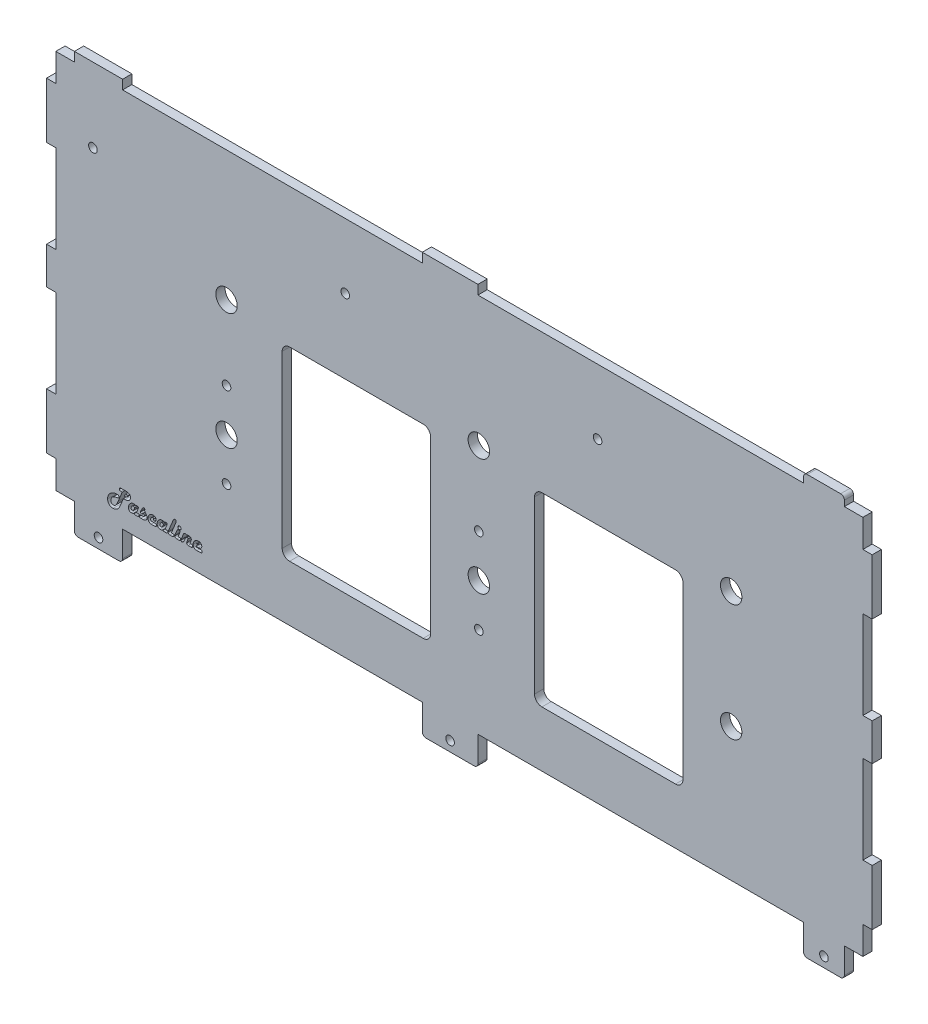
from build123d import *

# Parameters (mm, degrees)
SKETCH1_W             = 276.225
SKETCH1_H             = 130.175
SKETCH1_R             = 3.6703
SKETCH1_W_2           = 50.8
SKETCH1_H_2           = 63.5
BOSS_EXTRUDE1_DEPTH   = 3.175
FILLET1_R             = 2.54
SKETCH4_W             = 3.175
SKETCH4_H             = 19.05
SKETCH4_H_2           = 12.7
SKETCH4_W_2           = 16.51
SKETCH4_H_3           = 10.033
SKETCH4_W_3           = 19.05
SKETCH4_W_4           = 13.97
SKETCH4_H_4           = 3.175
BOSS_EXTRUDE2_DEPTH   = 3.175
F_4_CLEARANCE_HOLE1_D = 2.9464
FILLET2_R             = 1.27
CUT_EXTRUDE3_DEPTH    = 310.607272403


with BuildPart() as part:
    # Sketch1 → Boss-Extrude1 (new body)
    with BuildSketch(Plane.XY):
        with Locations((138.1125, 65.0875)):
            Rectangle(SKETCH1_W, SKETCH1_H)
        with Locations((58.42, 85.725)):
            Circle(SKETCH1_R, mode=Mode.SUBTRACT)
        with Locations((58.42, 45.72)):
            Circle(SKETCH1_R, mode=Mode.SUBTRACT)
        with Locations(Location((144.78, 45.72, 0), (0, 0, 180))):
            Circle(SKETCH1_R, mode=Mode.SUBTRACT)
        with Locations(Location((144.78, 85.725, 0), (0, 0, 180))):
            Circle(SKETCH1_R, mode=Mode.SUBTRACT)
        with Locations((231.14, 85.725)):
            Circle(SKETCH1_R, mode=Mode.SUBTRACT)
        with Locations((231.14, 45.72)):
            Circle(SKETCH1_R, mode=Mode.SUBTRACT)
        with Locations((102.87, 50.8)):
            Rectangle(SKETCH1_W_2, SKETCH1_H_2, mode=Mode.SUBTRACT)
        with Locations((189.23, 50.8)):
            Rectangle(SKETCH1_W_2, SKETCH1_H_2, mode=Mode.SUBTRACT)
    extrude(amount=BOSS_EXTRUDE1_DEPTH)

    # Fillet1
    fillet1_edges = [part.edges().sort_by_distance(p)[0] for p in [
        (128.27, 19.05, 1.5875),
        (128.27, 82.55, 1.5875),
        (77.47, 82.55, 1.5875),
        (77.47, 19.05, 1.5875),
        (214.63, 19.05, 1.5875),
        (214.63, 82.55, 1.5875),
        (163.83, 82.55, 1.5875),
        (163.83, 19.05, 1.5875),
    ]]
    fillet(fillet1_edges, radius=FILLET1_R)

    # Sketch4 → Boss-Extrude2 (add)
    with BuildSketch(Plane.XY):
        with Locations((277.8125, 19.05)):
            Rectangle(SKETCH4_W, SKETCH4_H)
        with Locations((277.8125, 111.125)):
            Rectangle(SKETCH4_W, SKETCH4_H)
        with Locations((-1.5875, 65.0875)):
            Rectangle(SKETCH4_W, SKETCH4_H_2)
        with Locations((277.8125, 65.0875)):
            Rectangle(SKETCH4_W, SKETCH4_H_2)
        with Locations((-1.5875, 19.05)):
            Rectangle(SKETCH4_W, SKETCH4_H)
        with Locations((-1.5875, 111.125)):
            Rectangle(SKETCH4_W, SKETCH4_H)
        with Locations((14.605, -5.0165)):
            Rectangle(SKETCH4_W_2, SKETCH4_H_3)
        with Locations((134.9375, -5.0165)):
            Rectangle(SKETCH4_W_3, SKETCH4_H_3)
        with Locations((262.89, -5.0165)):
            Rectangle(SKETCH4_W_4, SKETCH4_H_3)
        with Locations((14.605, 131.7625)):
            Rectangle(SKETCH4_W_2, SKETCH4_H_4)
        with Locations((134.9375, 131.7625)):
            Rectangle(SKETCH4_W_3, SKETCH4_H_4)
        with Locations((262.89, 131.7625)):
            Rectangle(SKETCH4_W_4, SKETCH4_H_4)
    extrude(amount=BOSS_EXTRUDE2_DEPTH)

    # 4 Clearance Hole1 (through all)
    with Locations(Plane.XY.offset(3.175)):
        with Locations((99.06, 107.95), (12.7, 107.95), (185.42, 107.95), (134.9375, -6.604), (14.605, -6.604), (262.89, -6.604), (58.42, 60.325), (58.42, 31.115), (144.78, 60.325), (144.78, 31.115)):
            Hole(F_4_CLEARANCE_HOLE1_D / 2)

    # Fillet2
    fillet2_edges = [part.edges().sort_by_distance(p)[0] for p in [
        (255.905, 133.35, 1.5875),
        (269.875, 133.35, 1.5875),
        (269.875, -10.033, 1.5875),
        (255.905, -10.033, 1.5875),
        (144.4625, -10.033, 1.5875),
        (125.4125, -10.033, 1.5875),
        (22.86, -10.033, 1.5875),
        (6.35, -10.033, 1.5875),
    ]]
    fillet(fillet2_edges, radius=FILLET2_R)

    # Sketch5 → Cut-Extrude3 (cut, through all)
    # profile 1 of 10: a face of its own
    with BuildSketch(Plane.XY.offset(3.175)):
        with BuildLine():
            Line((23.119201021, 9.164609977), (22.451206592, 7.500566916))
            add(Edge.make_bspline(
                [(22.451206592, 7.500566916), (22.411003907, 7.401430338), (22.333829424, 7.211124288), (22.219435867, 6.938643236), (22.112680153, 6.690113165), (22.012786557, 6.465475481), (21.920717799, 6.264069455), (21.833533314, 6.087517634), (21.755963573, 5.933870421), (21.661354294, 5.762755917), (21.539114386, 5.572432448), (21.375027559, 5.364837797), (21.194459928, 5.172753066), (21.060129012, 5.059889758), (20.992791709, 5.003313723)],
                knots=[0, 0, 0, 0, 1.315970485, 2.526183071, 3.635244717, 4.643279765, 5.550454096, 6.359128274, 7.065363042, 7.667512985, 8.763908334, 9.843272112, 10.918877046, 12, 12, 12, 12], degree=3))
            add(Edge.make_bspline(
                [(20.992791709, 5.003313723), (20.941866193, 4.965231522), (20.841070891, 4.889856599), (20.680401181, 4.792052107), (20.514563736, 4.708473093), (20.341573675, 4.641675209), (20.163005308, 4.589417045), (19.978244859, 4.551262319), (19.787353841, 4.528037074), (19.658056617, 4.52556047), (19.592618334, 4.524307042)],
                knots=[0, 0, 0, 0, 1.011044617, 2.001129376, 2.987597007, 3.961339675, 4.946518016, 5.943976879, 6.959431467, 8, 8, 8, 8], degree=3))
            add(Edge.make_bspline(
                [(19.592618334, 4.524307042), (19.523985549, 4.52577862), (19.389812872, 4.52865546), (19.193870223, 4.554855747), (19.007122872, 4.594062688), (18.83078106, 4.653339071), (18.663334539, 4.726507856), (18.506601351, 4.817898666), (18.35966799, 4.925082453), (18.22480845, 5.048815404), (18.102569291, 5.184697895), (17.996369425, 5.332046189), (17.904994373, 5.488467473), (17.831448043, 5.655681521), (17.774055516, 5.832504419), (17.734367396, 6.018966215), (17.708307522, 6.214954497), (17.70541107, 6.3491208), (17.70392946, 6.417750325)],
                knots=[0, 0, 0, 0, 1.095039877, 2.140732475, 3.150521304, 4.13652018, 5.104897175, 6.062745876, 7.026672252, 8.00261995, 8.979018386, 9.939223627, 10.897072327, 11.865449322, 12.849478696, 13.859267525, 14.904960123, 16, 16, 16, 16], degree=3))
            add(Edge.make_bspline(
                [(17.70392946, 6.417750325), (17.706469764, 6.510196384), (17.711485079, 6.692712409), (17.750571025, 6.961954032), (17.814671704, 7.222484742), (17.905671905, 7.473969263), (18.021297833, 7.716830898), (18.16431112, 7.949570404), (18.332042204, 8.17426002), (18.460931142, 8.313119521), (18.526442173, 8.383698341)],
                knots=[0, 0, 0, 0, 1.01377589, 2.001495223, 2.977585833, 3.952291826, 4.930103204, 5.92294397, 6.944284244, 8, 8, 8, 8], degree=3))
            add(Edge.make_bspline(
                [(18.526442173, 8.383698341), (18.564038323, 8.421013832), (18.639923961, 8.496332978), (18.762383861, 8.601213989), (18.891389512, 8.701406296), (19.026342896, 8.796968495), (19.169837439, 8.884085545), (19.318539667, 8.968473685), (19.475608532, 9.044630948), (19.690708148, 9.141268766), (19.965425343, 9.241006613), (20.2978387, 9.328678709), (20.629749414, 9.381793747), (20.850767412, 9.389158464), (20.96069945, 9.392821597)],
                knots=[0, 0, 0, 0, 0.706155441, 1.425333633, 2.148189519, 2.883981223, 3.628821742, 4.385725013, 5.163077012, 5.955384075, 7.529784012, 9.053423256, 10.534403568, 12, 12, 12, 12], degree=3))
            add(Edge.make_bspline(
                [(20.96069945, 9.392821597), (21.010777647, 9.391629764), (21.10661754, 9.389348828), (21.242284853, 9.36101028), (21.363435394, 9.317754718), (21.467338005, 9.255678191), (21.552788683, 9.180085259), (21.616087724, 9.091135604), (21.653226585, 8.989078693), (21.657440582, 8.917283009), (21.659597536, 8.880534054)],
                knots=[0, 0, 0, 0, 1.238826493, 2.370872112, 3.417595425, 4.41258701, 5.350953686, 6.225146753, 7.091533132, 8, 8, 8, 8], degree=3))
            add(Edge.make_bspline(
                [(21.659597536, 8.880534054), (21.657158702, 8.841764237), (21.65240403, 8.766179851), (21.612518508, 8.658791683), (21.545055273, 8.564566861), (21.48423124, 8.515858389), (21.452780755, 8.490672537)],
                knots=[0, 0, 0, 0, 1.010937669, 1.970891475, 2.950802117, 4, 4, 4, 4], degree=3))
            add(Edge.make_bspline(
                [(21.452780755, 8.490672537), (21.428650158, 8.476261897), (21.374303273, 8.443806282), (21.271172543, 8.413087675), (21.142728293, 8.387298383), (21.04721528, 8.377274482), (20.995168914, 8.371812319)],
                knots=[0, 0, 0, 0, 0.704559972, 1.586808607, 2.68501851, 4, 4, 4, 4], degree=3))
            add(Edge.make_bspline(
                [(20.995168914, 8.371812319), (20.930899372, 8.36533971), (20.80556437, 8.352717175), (20.622961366, 8.323144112), (20.44919412, 8.289935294), (20.285218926, 8.246571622), (20.130183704, 8.19766871), (19.983692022, 8.144126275), (19.847574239, 8.080489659), (19.761927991, 8.032764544), (19.719798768, 8.009288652)],
                knots=[0, 0, 0, 0, 1.159710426, 2.261604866, 3.320677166, 4.335395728, 5.305245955, 6.239579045, 7.134052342, 8, 8, 8, 8], degree=3))
            add(Edge.make_bspline(
                [(19.719798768, 8.009288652), (19.654419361, 7.967339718), (19.52562533, 7.884702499), (19.354426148, 7.733222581), (19.203332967, 7.564964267), (19.075629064, 7.379109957), (18.973627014, 7.181271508), (18.89879096, 6.976254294), (18.852926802, 6.765270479), (18.847636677, 6.622412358), (18.844987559, 6.550873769)],
                knots=[0, 0, 0, 0, 1.047576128, 2.063670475, 3.075290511, 4.094745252, 5.099666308, 6.072755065, 7.034899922, 8, 8, 8, 8], degree=3))
            add(Edge.make_bspline(
                [(18.844987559, 6.550873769), (18.845636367, 6.515185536), (18.846908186, 6.445228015), (18.857899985, 6.343133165), (18.875018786, 6.246246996), (18.901788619, 6.15588907), (18.933862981, 6.070634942), (18.972695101, 5.990387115), (19.020918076, 5.917086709), (19.073977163, 5.848438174), (19.13513267, 5.788442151), (19.199905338, 5.73415304), (19.271326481, 5.690354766), (19.346543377, 5.652700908), (19.427352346, 5.624580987), (19.513023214, 5.604540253), (19.603256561, 5.590584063), (19.665464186, 5.589730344), (19.697215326, 5.589294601)],
                knots=[0, 0, 0, 0, 1.180906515, 2.314860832, 3.395146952, 4.432720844, 5.428859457, 6.408284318, 7.375873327, 8.328235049, 9.274073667, 10.205991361, 11.119268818, 12.040047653, 12.985704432, 13.943108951, 14.9501506, 16, 16, 16, 16], degree=3))
            add(Edge.make_bspline(
                [(19.697215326, 5.589294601), (19.73772721, 5.590178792), (19.817696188, 5.591924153), (19.934736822, 5.613557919), (20.047745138, 5.64535598), (20.156538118, 5.691126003), (20.261491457, 5.749525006), (20.361851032, 5.821430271), (20.457232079, 5.906838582), (20.550130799, 6.005691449), (20.640514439, 6.122252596), (20.735291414, 6.255321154), (20.829339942, 6.410668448), (20.926497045, 6.585296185), (21.026287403, 6.779583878), (21.128874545, 6.99369617), (21.231187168, 7.22917089), (21.299659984, 7.393110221), (21.335109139, 7.477983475)],
                knots=[0, 0, 0, 0, 0.731682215, 1.444313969, 2.14503258, 2.851587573, 3.573238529, 4.31284086, 5.079201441, 5.885132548, 6.76239785, 7.744387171, 8.838039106, 10.04403949, 11.357848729, 12.787140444, 14.336666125, 16, 16, 16, 16], degree=3))
            Line((21.335109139, 7.477983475), (22.730528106, 10.914232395))
            Line((22.730528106, 10.914232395), (22.293122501, 10.914232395))
            add(Edge.make_bspline(
                [(22.293122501, 10.914232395), (22.249482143, 10.915318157), (22.167784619, 10.917350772), (22.053469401, 10.933486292), (21.955911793, 10.96103767), (21.875553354, 11.001448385), (21.812083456, 11.0538411), (21.766552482, 11.118910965), (21.739607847, 11.196317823), (21.737016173, 11.251577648), (21.735668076, 11.280321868)],
                knots=[0, 0, 0, 0, 1.386647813, 2.595892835, 3.659749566, 4.594681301, 5.434731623, 6.248703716, 7.089037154, 8, 8, 8, 8], degree=3))
            add(Edge.make_bspline(
                [(21.735668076, 11.280321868), (21.737604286, 11.321461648), (21.741339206, 11.400819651), (21.780099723, 11.512122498), (21.841922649, 11.609323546), (21.930694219, 11.688476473), (22.040352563, 11.751577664), (22.17060237, 11.796320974), (22.320267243, 11.821779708), (22.426142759, 11.825246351), (22.482110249, 11.827078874)],
                knots=[0, 0, 0, 0, 0.942601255, 1.818263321, 2.674766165, 3.564433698, 4.523656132, 5.566505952, 6.713616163, 8, 8, 8, 8], degree=3))
            Line((22.482110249, 11.827078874), (24.009464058, 11.827078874))
            add(Edge.make_bspline(
                [(24.009464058, 11.827078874), (24.07248493, 11.826141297), (24.194705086, 11.824322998), (24.371659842, 11.811086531), (24.536158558, 11.790426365), (24.687661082, 11.7598162), (24.826003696, 11.719494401), (24.951704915, 11.670604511), (25.065549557, 11.614116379), (25.166457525, 11.546868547), (25.254881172, 11.47075861), (25.331318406, 11.384834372), (25.394973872, 11.289168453), (25.449869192, 11.185035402), (25.489653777, 11.069843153), (25.51766631, 10.945418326), (25.536143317, 10.81176616), (25.53815736, 10.719365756), (25.539195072, 10.671757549)],
                knots=[0, 0, 0, 0, 1.377685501, 2.671828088, 3.877302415, 5.000186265, 6.047243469, 7.023626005, 7.94558449, 8.820055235, 9.667510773, 10.489711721, 11.325757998, 12.174186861, 13.056345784, 13.980864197, 14.959664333, 16, 16, 16, 16], degree=3))
            add(Edge.make_bspline(
                [(25.539195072, 10.671757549), (25.537217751, 10.613032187), (25.533336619, 10.497764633), (25.507219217, 10.328808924), (25.461558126, 10.168586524), (25.398541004, 10.016101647), (25.315426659, 9.873155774), (25.215734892, 9.73744145), (25.098243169, 9.609536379), (25.007634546, 9.534438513), (24.961534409, 9.496229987)],
                knots=[0, 0, 0, 0, 1.037190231, 2.03582197, 3.010506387, 3.973515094, 4.942177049, 5.923321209, 6.943420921, 8, 8, 8, 8], degree=3))
            add(Edge.make_bspline(
                [(24.961534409, 9.496229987), (24.924861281, 9.469591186), (24.849567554, 9.414898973), (24.722279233, 9.347795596), (24.581294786, 9.290628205), (24.42582274, 9.24494617), (24.257052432, 9.208122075), (24.073914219, 9.182358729), (23.876613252, 9.166850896), (23.740077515, 9.16537344), (23.669523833, 9.164609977)],
                knots=[0, 0, 0, 0, 0.800437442, 1.643380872, 2.535600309, 3.486195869, 4.50417187, 5.586788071, 6.752993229, 8, 8, 8, 8], degree=3))
            Line((23.669523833, 9.164609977), (23.119201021, 9.164609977))
        make_face()
        with BuildLine():
            Line((23.509062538, 10.077456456), (23.833550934, 10.077456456))
            add(Edge.make_bspline(
                [(23.833550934, 10.077456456), (23.883581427, 10.078871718), (23.978009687, 10.081542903), (24.109812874, 10.105830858), (24.222265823, 10.147368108), (24.315221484, 10.206091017), (24.38842248, 10.283422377), (24.437974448, 10.379084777), (24.470358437, 10.489814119), (24.47287967, 10.569284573), (24.474207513, 10.611138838)],
                knots=[0, 0, 0, 0, 1.258971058, 2.376199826, 3.358208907, 4.260347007, 5.121448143, 6.005251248, 6.949436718, 8, 8, 8, 8], degree=3))
            add(Edge.make_bspline(
                [(24.474207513, 10.611138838), (24.473067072, 10.634992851), (24.470906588, 10.680182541), (24.45485612, 10.743618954), (24.424912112, 10.796445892), (24.384765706, 10.841296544), (24.331090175, 10.873849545), (24.267531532, 10.898068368), (24.192697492, 10.911946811), (24.139079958, 10.913437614), (24.110495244, 10.914232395)],
                knots=[0, 0, 0, 0, 1.057975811, 2.004258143, 2.869579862, 3.727735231, 4.644179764, 5.623179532, 6.73286349, 8, 8, 8, 8], degree=3))
            Line((24.110495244, 10.914232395), (23.84187115, 10.914232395))
            Line((23.84187115, 10.914232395), (23.509062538, 10.077456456))
        make_face(mode=Mode.SUBTRACT)
    # profile 2 of 10: a face of its own
    with BuildSketch(Plane.XY.offset(3.175)):
        with BuildLine():
            Line((27.590722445, 7.262846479), (28.032882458, 7.262846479))
            add(Edge.make_bspline(
                [(28.032882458, 7.262846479), (28.069771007, 7.26168404), (28.139217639, 7.259495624), (28.237100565, 7.244044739), (28.319497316, 7.213913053), (28.389453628, 7.175207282), (28.441730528, 7.120759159), (28.479643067, 7.055670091), (28.502815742, 6.978700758), (28.504866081, 6.923472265), (28.505946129, 6.894379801)],
                knots=[0, 0, 0, 0, 1.294214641, 2.436497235, 3.45633191, 4.35958604, 5.214514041, 6.067746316, 6.982155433, 8, 8, 8, 8], degree=3))
            add(Edge.make_bspline(
                [(28.505946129, 6.894379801), (28.504075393, 6.853751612), (28.500488, 6.775841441), (28.467922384, 6.66547908), (28.411237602, 6.570686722), (28.335484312, 6.489620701), (28.239850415, 6.426705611), (28.127852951, 6.380604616), (27.999107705, 6.355527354), (27.90818237, 6.351900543), (27.860535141, 6.35)],
                knots=[0, 0, 0, 0, 1.02006706, 1.956119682, 2.85821293, 3.77438774, 4.72208319, 5.713685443, 6.801912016, 8, 8, 8, 8], degree=3))
            Line((27.860535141, 6.35), (27.347058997, 6.35))
            add(Edge.make_bspline(
                [(27.347058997, 6.35), (27.319272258, 6.350924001), (27.266140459, 6.35269081), (27.189661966, 6.365809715), (27.119931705, 6.388489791), (27.056725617, 6.420297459), (27.001086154, 6.461923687), (26.951568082, 6.511009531), (26.909321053, 6.570088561), (26.888358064, 6.614676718), (26.877561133, 6.637641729)],
                knots=[0, 0, 0, 0, 1.135602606, 2.17141737, 3.159933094, 4.123316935, 5.049777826, 5.988893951, 6.964185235, 8, 8, 8, 8], degree=3))
            add(Edge.make_bspline(
                [(26.877561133, 6.637641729), (26.829418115, 6.593791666), (26.738706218, 6.511168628), (26.589078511, 6.421916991), (26.442765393, 6.360717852), (26.343224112, 6.353490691), (26.295146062, 6.35)],
                knots=[0, 0, 0, 0, 1.172355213, 2.208971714, 3.134940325, 4, 4, 4, 4], degree=3))
            Line((26.295146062, 6.35), (25.838722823, 6.35))
            add(Edge.make_bspline(
                [(25.838722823, 6.35), (25.802613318, 6.350846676), (25.732080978, 6.352500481), (25.629021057, 6.36739538), (25.530996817, 6.390336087), (25.439134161, 6.425910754), (25.351766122, 6.468220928), (25.269891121, 6.521254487), (25.194345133, 6.584489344), (25.123714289, 6.655720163), (25.061392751, 6.735720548), (25.004824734, 6.82093039), (24.958631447, 6.913392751), (24.9203783, 7.011259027), (24.891018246, 7.114802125), (24.869013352, 7.224008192), (24.857836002, 7.339477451), (24.855668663, 7.418533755), (24.854560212, 7.45896584)],
                knots=[0, 0, 0, 0, 1.038881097, 2.029236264, 2.991883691, 3.930308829, 4.858629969, 5.782385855, 6.730121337, 7.689859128, 8.664191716, 9.644845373, 10.629272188, 11.633194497, 12.665607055, 13.723595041, 14.835769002, 16, 16, 16, 16], degree=3))
            add(Edge.make_bspline(
                [(24.854560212, 7.45896584), (24.85610135, 7.520862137), (24.859147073, 7.643186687), (24.885247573, 7.824235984), (24.926425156, 8.000246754), (24.985151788, 8.171403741), (25.060821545, 8.33685869), (25.150817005, 8.498507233), (25.260719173, 8.653277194), (25.383466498, 8.802278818), (25.517065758, 8.939411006), (25.65634466, 9.060947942), (25.801550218, 9.162226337), (25.949498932, 9.247803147), (26.103529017, 9.312208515), (26.26118757, 9.359174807), (26.423717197, 9.387067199), (26.533554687, 9.390897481), (26.588730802, 9.392821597)],
                knots=[0, 0, 0, 0, 1.038393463, 2.052158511, 3.063456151, 4.068635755, 5.08344709, 6.113632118, 7.168837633, 8.264602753, 9.350863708, 10.378663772, 11.361961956, 12.31789787, 13.241700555, 14.156967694, 15.07416527, 16, 16, 16, 16], degree=3))
            add(Edge.make_bspline(
                [(26.588730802, 9.392821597), (26.629955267, 9.391802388), (26.709847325, 9.389827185), (26.825936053, 9.377663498), (26.93284671, 9.352720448), (27.032648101, 9.323430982), (27.12225627, 9.280706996), (27.204008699, 9.230733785), (27.277694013, 9.171469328), (27.318416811, 9.124076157), (27.338738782, 9.100425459)],
                knots=[0, 0, 0, 0, 1.187749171, 2.30183041, 3.353985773, 4.346587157, 5.291117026, 6.203238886, 7.103359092, 8, 8, 8, 8], degree=3))
            add(Edge.make_bspline(
                [(27.338738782, 9.100425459), (27.355674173, 9.123800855), (27.388572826, 9.169209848), (27.444893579, 9.229036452), (27.505129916, 9.279630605), (27.568893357, 9.321936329), (27.638154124, 9.352158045), (27.709275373, 9.377183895), (27.78560771, 9.389834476), (27.837518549, 9.391809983), (27.864100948, 9.392821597)],
                knots=[0, 0, 0, 0, 1.102961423, 2.142610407, 3.131917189, 4.106850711, 5.056016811, 6.014208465, 6.983119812, 8, 8, 8, 8], degree=3))
            add(Edge.make_bspline(
                [(27.864100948, 9.392821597), (27.892332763, 9.391374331), (27.947568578, 9.388542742), (28.026788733, 9.368747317), (28.097661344, 9.332619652), (28.159912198, 9.285477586), (28.212990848, 9.22913499), (28.25007614, 9.163329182), (28.274365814, 9.091402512), (28.276592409, 9.040801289), (28.277734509, 9.014846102)],
                knots=[0, 0, 0, 0, 1.085152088, 2.123110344, 3.11068521, 4.121931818, 5.11360817, 6.061884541, 7.005870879, 8, 8, 8, 8], degree=3))
            add(Edge.make_bspline(
                [(28.277734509, 9.014846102), (28.277038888, 8.995776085), (28.275563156, 8.955319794), (28.262690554, 8.892397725), (28.242496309, 8.824341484), (28.223506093, 8.778549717), (28.213549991, 8.754542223)],
                knots=[0, 0, 0, 0, 0.847236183, 1.797378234, 2.845219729, 4, 4, 4, 4], degree=3))
            Line((28.213549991, 8.754542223), (28.16957171, 8.648756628))
            Line((28.16957171, 8.648756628), (27.590722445, 7.262846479))
        make_face()
        with BuildLine():
            Line((26.134684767, 7.262846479), (26.235715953, 7.262846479))
            add(Edge.make_bspline(
                [(26.235715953, 7.262846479), (26.261118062, 7.263403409), (26.310245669, 7.264480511), (26.380704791, 7.276313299), (26.444219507, 7.296625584), (26.501442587, 7.324150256), (26.551533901, 7.360081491), (26.595304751, 7.403527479), (26.631459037, 7.455722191), (26.649532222, 7.494711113), (26.658858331, 7.514830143)],
                knots=[0, 0, 0, 0, 1.157664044, 2.238919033, 3.244614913, 4.190073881, 5.122668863, 6.042574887, 6.989931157, 8, 8, 8, 8], degree=3))
            Line((26.658858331, 7.514830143), (26.92985963, 8.166184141))
            add(Edge.make_bspline(
                [(26.92985963, 8.166184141), (26.946051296, 8.204845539), (26.974847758, 8.27360384), (26.981585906, 8.347699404), (26.98453533, 8.380132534)],
                knots=[0, 0, 0, 0, 1.124559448, 2, 2, 2, 2], degree=3))
            add(Edge.make_bspline(
                [(26.98453533, 8.380132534), (26.982919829, 8.396510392), (26.979660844, 8.429549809), (26.960273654, 8.478036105), (26.923140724, 8.519372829), (26.877468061, 8.558290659), (26.822149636, 8.591249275), (26.759781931, 8.614843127), (26.692035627, 8.629673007), (26.645070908, 8.631284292), (26.620823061, 8.632116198)],
                knots=[0, 0, 0, 0, 0.81058345, 1.635208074, 2.524363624, 3.523748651, 4.593951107, 5.683817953, 6.804157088, 8, 8, 8, 8], degree=3))
            add(Edge.make_bspline(
                [(26.620823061, 8.632116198), (26.596174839, 8.63128371), (26.546394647, 8.629602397), (26.472572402, 8.613117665), (26.399545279, 8.588130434), (26.327079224, 8.552743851), (26.255132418, 8.507577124), (26.183183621, 8.452598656), (26.113420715, 8.386315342), (26.021876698, 8.289084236), (25.923002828, 8.158030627), (25.834330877, 7.992365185), (25.778103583, 7.822683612), (25.770947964, 7.707389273), (25.767406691, 7.650330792)],
                knots=[0, 0, 0, 0, 0.627706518, 1.267732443, 1.919531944, 2.592823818, 3.31892668, 4.082778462, 4.897707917, 5.769757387, 7.487317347, 9.064628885, 10.547302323, 12, 12, 12, 12], degree=3))
            add(Edge.make_bspline(
                [(25.767406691, 7.650330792), (25.768547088, 7.620143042), (25.770712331, 7.562826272), (25.786711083, 7.482537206), (25.814989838, 7.413874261), (25.857126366, 7.358291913), (25.910530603, 7.314821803), (25.97542406, 7.283164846), (26.051786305, 7.265877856), (26.106072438, 7.263892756), (26.134684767, 7.262846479)],
                knots=[0, 0, 0, 0, 1.183693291, 2.247450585, 3.194323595, 4.070859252, 4.954393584, 5.871857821, 6.878330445, 8, 8, 8, 8], degree=3))
        make_face(mode=Mode.SUBTRACT)
    # profile 3 of 10: a face of its own
    with BuildSketch(Plane.XY.offset(3.175)):
        with BuildLine():
            Line((29.990510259, 8.330211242), (29.912062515, 8.16024113))
            add(Edge.make_bspline(
                [(29.912062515, 8.16024113), (29.896884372, 8.131312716), (29.86769618, 8.07568219), (29.814544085, 8.00141012), (29.757815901, 7.937540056), (29.695046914, 7.885850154), (29.628129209, 7.844607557), (29.555769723, 7.815808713), (29.478606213, 7.79887687), (29.425612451, 7.796534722), (29.39858637, 7.795340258)],
                knots=[0, 0, 0, 0, 1.174117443, 2.257875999, 3.277186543, 4.239058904, 5.172954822, 6.09414408, 7.028039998, 8, 8, 8, 8], degree=3))
            add(Edge.make_bspline(
                [(29.39858637, 7.795340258), (29.371134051, 7.796795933), (29.316667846, 7.799684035), (29.237096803, 7.82031378), (29.16263589, 7.855638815), (29.09462143, 7.902428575), (29.037107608, 7.958103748), (28.993789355, 8.019877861), (28.967174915, 8.086882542), (28.963967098, 8.133470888), (28.962369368, 8.156675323)],
                knots=[0, 0, 0, 0, 1.057292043, 2.097698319, 3.142574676, 4.21811325, 5.26521749, 6.20945791, 7.108177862, 8, 8, 8, 8], degree=3))
            add(Edge.make_bspline(
                [(28.962369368, 8.156675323), (28.963902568, 8.18098518), (28.967274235, 8.234445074), (28.992789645, 8.318434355), (29.027799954, 8.414397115), (29.061029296, 8.47951667), (29.078852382, 8.514444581)],
                knots=[0, 0, 0, 0, 0.768398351, 1.68978755, 2.760880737, 4, 4, 4, 4], degree=3))
            Line((29.078852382, 8.514444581), (29.612534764, 9.55209429))
            add(Edge.make_bspline(
                [(29.612534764, 9.55209429), (29.628998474, 9.581760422), (29.660355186, 9.638262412), (29.714608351, 9.714353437), (29.771846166, 9.778597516), (29.830813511, 9.833390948), (29.894697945, 9.874194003), (29.961322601, 9.90314064), (30.030689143, 9.921974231), (30.078349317, 9.92419981), (30.102238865, 9.925315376)],
                knots=[0, 0, 0, 0, 1.254889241, 2.390056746, 3.44940031, 4.435704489, 5.358962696, 6.23882182, 7.117213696, 8, 8, 8, 8], degree=3))
            add(Edge.make_bspline(
                [(30.102238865, 9.925315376), (30.127723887, 9.924333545), (30.177477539, 9.922416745), (30.249027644, 9.902648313), (30.314253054, 9.870016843), (30.371649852, 9.82561983), (30.422350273, 9.775108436), (30.456581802, 9.715249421), (30.480139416, 9.651678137), (30.482550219, 9.606987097), (30.483780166, 9.584186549)],
                knots=[0, 0, 0, 0, 1.076175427, 2.100985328, 3.113101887, 4.142426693, 5.162150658, 6.116677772, 7.039163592, 8, 8, 8, 8], degree=3))
            add(Edge.make_bspline(
                [(30.483780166, 9.584186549), (30.483189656, 9.576625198), (30.481707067, 9.55764097), (30.472108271, 9.524410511), (30.457923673, 9.48041725), (30.445526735, 9.447837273), (30.438613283, 9.429668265)],
                knots=[0, 0, 0, 0, 0.562304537, 1.411773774, 2.556613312, 4, 4, 4, 4], degree=3))
            add(Edge.make_bspline(
                [(30.438613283, 9.429668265), (30.429934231, 9.4021552), (30.4139082, 9.351351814), (30.409658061, 9.29828798), (30.407709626, 9.273961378)],
                knots=[0, 0, 0, 0, 1.083119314, 2, 2, 2, 2], degree=3))
            add(Edge.make_bspline(
                [(30.407709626, 9.273961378), (30.410360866, 9.231672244), (30.41576673, 9.145444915), (30.457407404, 9.016624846), (30.521341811, 8.886134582), (30.581783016, 8.805145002), (30.613337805, 8.762862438)],
                knots=[0, 0, 0, 0, 0.903479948, 1.84219102, 2.873463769, 4, 4, 4, 4], degree=3))
            Line((30.613337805, 8.762862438), (30.862944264, 8.449071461))
            add(Edge.make_bspline(
                [(30.862944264, 8.449071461), (30.89315876, 8.40941273), (30.95181765, 8.332418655), (31.029517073, 8.213642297), (31.096639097, 8.096689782), (31.150204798, 7.979553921), (31.192582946, 7.863611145), (31.222000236, 7.748525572), (31.241056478, 7.634323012), (31.243346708, 7.558484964), (31.244485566, 7.520773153)],
                knots=[0, 0, 0, 0, 1.169686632, 2.270847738, 3.328397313, 4.331060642, 5.289870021, 6.221237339, 7.115478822, 8, 8, 8, 8], degree=3))
            add(Edge.make_bspline(
                [(31.244485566, 7.520773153), (31.243374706, 7.479898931), (31.241185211, 7.399336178), (31.222953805, 7.281348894), (31.193158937, 7.168541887), (31.151222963, 7.060930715), (31.097710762, 6.958280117), (31.031457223, 6.861340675), (30.953690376, 6.769443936), (30.865170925, 6.683679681), (30.768195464, 6.604874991), (30.663003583, 6.537900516), (30.55370701, 6.478341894), (30.437152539, 6.432662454), (30.315721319, 6.395108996), (30.188203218, 6.369932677), (30.055210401, 6.351843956), (29.964426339, 6.35062387), (29.918005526, 6.35)],
                knots=[0, 0, 0, 0, 0.993241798, 1.957671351, 2.894532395, 3.824635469, 4.759513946, 5.702543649, 6.673110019, 7.681185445, 8.695042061, 9.70491044, 10.708882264, 11.715852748, 12.742665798, 13.794825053, 14.872423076, 16, 16, 16, 16], degree=3))
            Line((29.918005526, 6.35), (29.080040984, 6.35))
            add(Edge.make_bspline(
                [(29.080040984, 6.35), (29.041166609, 6.351148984), (28.968164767, 6.353306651), (28.865667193, 6.368799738), (28.778850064, 6.39860707), (28.70672086, 6.439016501), (28.649687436, 6.491477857), (28.609138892, 6.556610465), (28.58673032, 6.634252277), (28.583643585, 6.689400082), (28.582016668, 6.718466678)],
                knots=[0, 0, 0, 0, 1.323532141, 2.485449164, 3.513452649, 4.431917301, 5.281225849, 6.123328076, 7.010867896, 8, 8, 8, 8], degree=3))
            add(Edge.make_bspline(
                [(28.582016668, 6.718466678), (28.583766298, 6.759131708), (28.587126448, 6.837228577), (28.621444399, 6.947402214), (28.678777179, 7.042559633), (28.758030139, 7.122462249), (28.857096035, 7.185049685), (28.972704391, 7.232327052), (29.105937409, 7.257322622), (29.199599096, 7.26094353), (29.248822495, 7.262846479)],
                knots=[0, 0, 0, 0, 1.001377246, 1.923137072, 2.813709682, 3.719614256, 4.674449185, 5.687788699, 6.784829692, 8, 8, 8, 8], degree=3))
            Line((29.248822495, 7.262846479), (29.71356595, 7.262846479))
            add(Edge.make_bspline(
                [(29.71356595, 7.262846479), (29.761976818, 7.263714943), (29.852890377, 7.265345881), (29.979460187, 7.28416678), (30.087169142, 7.314282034), (30.176102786, 7.356875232), (30.246912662, 7.412505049), (30.297305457, 7.482368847), (30.326991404, 7.565690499), (30.330040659, 7.625120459), (30.331639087, 7.656273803)],
                knots=[0, 0, 0, 0, 1.402558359, 2.633945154, 3.698995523, 4.63394819, 5.475307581, 6.281836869, 7.099334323, 8, 8, 8, 8], degree=3))
            add(Edge.make_bspline(
                [(30.331639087, 7.656273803), (30.329759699, 7.681390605), (30.325750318, 7.734973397), (30.29981842, 7.817251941), (30.260510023, 7.906123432), (30.223911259, 7.964172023), (30.204458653, 7.995025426)],
                knots=[0, 0, 0, 0, 0.822745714, 1.755200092, 2.806866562, 4, 4, 4, 4], degree=3))
            Line((30.204458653, 7.995025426), (29.990510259, 8.330211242))
        make_face()
    # profile 4 of 10: a face of its own
    with BuildSketch(Plane.XY.offset(3.175)):
        with BuildLine():
            Line((33.843958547, 6.35), (32.680317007, 6.35))
            add(Edge.make_bspline(
                [(32.680317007, 6.35), (32.639473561, 6.351331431), (32.559475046, 6.353939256), (32.442122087, 6.368805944), (32.331089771, 6.397249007), (32.224677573, 6.432858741), (32.125228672, 6.482977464), (32.031435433, 6.542005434), (31.943344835, 6.612135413), (31.862148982, 6.692296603), (31.788904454, 6.781373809), (31.723642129, 6.876673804), (31.67087138, 6.979950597), (31.624984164, 7.087986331), (31.590247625, 7.203147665), (31.567630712, 7.324780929), (31.550914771, 7.452170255), (31.549492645, 7.539336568), (31.548767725, 7.583769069)],
                knots=[0, 0, 0, 0, 1.04308008, 2.043041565, 3.012085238, 3.965374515, 4.901770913, 5.84746328, 6.790555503, 7.770466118, 8.754752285, 9.731054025, 10.712842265, 11.710345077, 12.724731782, 13.776116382, 14.86638876, 16, 16, 16, 16], degree=3))
            add(Edge.make_bspline(
                [(31.548767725, 7.583769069), (31.550434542, 7.643669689), (31.553726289, 7.761965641), (31.577855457, 7.936444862), (31.618616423, 8.105181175), (31.675046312, 8.268099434), (31.750410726, 8.42377383), (31.839361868, 8.574392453), (31.946140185, 8.718148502), (32.065971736, 8.855189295), (32.19833574, 8.979735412), (32.336825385, 9.090917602), (32.481896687, 9.184309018), (32.632077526, 9.261377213), (32.789231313, 9.319248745), (32.951349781, 9.362816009), (33.119703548, 9.388030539), (33.233728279, 9.391214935), (33.29125853, 9.392821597)],
                knots=[0, 0, 0, 0, 1.033018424, 2.040077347, 3.031267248, 4.023304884, 5.007568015, 6.009629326, 7.036117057, 8.091719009, 9.145549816, 10.16692925, 11.15074152, 12.116516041, 13.072326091, 14.033738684, 15.007938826, 16, 16, 16, 16], degree=3))
            add(Edge.make_bspline(
                [(33.29125853, 9.392821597), (33.330123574, 9.39229061), (33.406065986, 9.391253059), (33.516835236, 9.378681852), (33.62234278, 9.360223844), (33.721984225, 9.332564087), (33.816684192, 9.298575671), (33.904919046, 9.254933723), (33.988753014, 9.205465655), (34.065535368, 9.147041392), (34.135215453, 9.083436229), (34.197063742, 9.015218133), (34.248354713, 8.941154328), (34.289538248, 8.862143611), (34.324343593, 8.779529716), (34.345526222, 8.691155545), (34.361010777, 8.598583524), (34.362575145, 8.535117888), (34.363377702, 8.502558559)],
                knots=[0, 0, 0, 0, 1.192851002, 2.330834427, 3.419016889, 4.478598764, 5.502444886, 6.503631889, 7.49680333, 8.487139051, 9.460210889, 10.390750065, 11.308717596, 12.217610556, 13.123567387, 14.053072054, 15.001181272, 16, 16, 16, 16], degree=3))
            add(Edge.make_bspline(
                [(34.363377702, 8.502558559), (34.361783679, 8.458384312), (34.358716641, 8.37338923), (34.328641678, 8.252278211), (34.283123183, 8.141976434), (34.216010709, 8.047284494), (34.135293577, 7.969033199), (34.041830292, 7.91161127), (33.936681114, 7.87676091), (33.862847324, 7.873225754), (33.824940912, 7.871410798)],
                knots=[0, 0, 0, 0, 1.140049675, 2.193554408, 3.207776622, 4.208142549, 5.171800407, 6.095933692, 7.022448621, 8, 8, 8, 8], degree=3))
            add(Edge.make_bspline(
                [(33.824940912, 7.871410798), (33.795542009, 7.87215502), (33.740311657, 7.873553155), (33.663568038, 7.888085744), (33.597715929, 7.909794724), (33.543778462, 7.942790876), (33.500419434, 7.984790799), (33.471820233, 8.038507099), (33.453420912, 8.100004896), (33.451523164, 8.144247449), (33.450531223, 8.167372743)],
                knots=[0, 0, 0, 0, 1.293872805, 2.430738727, 3.43019671, 4.33150824, 5.195698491, 6.055468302, 6.983605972, 8, 8, 8, 8], degree=3))
            add(Edge.make_bspline(
                [(33.450531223, 8.167372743), (33.450531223, 8.181239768), (33.450531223, 8.206596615), (33.450531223, 8.231953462), (33.450531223, 8.243443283)],
                knots=[0, 0, 0, 0, 1.09375, 2, 2, 2, 2], degree=3))
            add(Edge.make_bspline(
                [(33.450531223, 8.243443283), (33.450531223, 8.255725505), (33.450531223, 8.279497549), (33.450531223, 8.303269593), (33.450531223, 8.314759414)],
                knots=[0, 0, 0, 0, 1.033333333, 2, 2, 2, 2], degree=3))
            add(Edge.make_bspline(
                [(33.450531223, 8.314759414), (33.44967953, 8.333876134), (33.448077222, 8.369840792), (33.434613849, 8.419916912), (33.413511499, 8.463087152), (33.380914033, 8.497551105), (33.339478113, 8.523737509), (33.289753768, 8.542520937), (33.231618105, 8.554749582), (33.189901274, 8.555594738), (33.167643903, 8.556045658)],
                knots=[0, 0, 0, 0, 1.076936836, 2.026062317, 2.906040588, 3.760364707, 4.665822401, 5.649858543, 6.746118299, 8, 8, 8, 8], degree=3))
            add(Edge.make_bspline(
                [(33.167643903, 8.556045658), (33.123621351, 8.553163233), (33.034942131, 8.547356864), (32.906677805, 8.495910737), (32.786484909, 8.413771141), (32.676556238, 8.304885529), (32.583034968, 8.177699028), (32.511892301, 8.039385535), (32.470278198, 7.891609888), (32.464516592, 7.790439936), (32.461614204, 7.739475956)],
                knots=[0, 0, 0, 0, 0.889989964, 1.79279967, 2.759962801, 3.828151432, 4.914528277, 5.949409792, 6.967022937, 8, 8, 8, 8], degree=3))
            add(Edge.make_bspline(
                [(32.461614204, 7.739475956), (32.463855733, 7.699247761), (32.468094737, 7.623171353), (32.500732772, 7.517048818), (32.560782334, 7.431656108), (32.643809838, 7.363978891), (32.755272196, 7.317078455), (32.894754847, 7.2858988), (33.064490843, 7.266324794), (33.187790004, 7.264066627), (33.254411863, 7.262846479)],
                knots=[0, 0, 0, 0, 0.913027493, 1.726645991, 2.482782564, 3.249916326, 4.127695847, 5.201188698, 6.487726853, 8, 8, 8, 8], degree=3))
            Line((33.254411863, 7.262846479), (34.012740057, 7.262846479))
            add(Edge.make_bspline(
                [(34.012740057, 7.262846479), (34.052054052, 7.261906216), (34.125991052, 7.260137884), (34.229054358, 7.242045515), (34.317391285, 7.214818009), (34.390470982, 7.173472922), (34.447565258, 7.119330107), (34.488145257, 7.052929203), (34.510965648, 6.974664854), (34.513940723, 6.919099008), (34.515518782, 6.889625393)],
                knots=[0, 0, 0, 0, 1.322009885, 2.486276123, 3.511116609, 4.419281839, 5.287086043, 6.131096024, 7.008683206, 8, 8, 8, 8], degree=3))
            add(Edge.make_bspline(
                [(34.515518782, 6.889625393), (34.513867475, 6.849711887), (34.510676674, 6.772587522), (34.474586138, 6.664416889), (34.416987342, 6.569236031), (34.336227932, 6.489587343), (34.236195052, 6.426608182), (34.119790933, 6.380845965), (33.986884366, 6.355420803), (33.893195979, 6.351867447), (33.843958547, 6.35)],
                knots=[0, 0, 0, 0, 0.982987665, 1.899414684, 2.782606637, 3.710260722, 4.674394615, 5.685217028, 6.783478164, 8, 8, 8, 8], degree=3))
        make_face()
    # profile 5 of 10: a face of its own
    with BuildSketch(Plane.XY.offset(3.175)):
        with BuildLine():
            Line((37.403822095, 7.262846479), (37.845982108, 7.262846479))
            add(Edge.make_bspline(
                [(37.845982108, 7.262846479), (37.882870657, 7.26168404), (37.952317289, 7.259495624), (38.050200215, 7.244044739), (38.132596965, 7.213913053), (38.202553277, 7.175207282), (38.254830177, 7.120759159), (38.292742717, 7.055670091), (38.315915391, 6.978700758), (38.31796573, 6.923472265), (38.319045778, 6.894379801)],
                knots=[0, 0, 0, 0, 1.294214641, 2.436497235, 3.45633191, 4.35958604, 5.214514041, 6.067746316, 6.982155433, 8, 8, 8, 8], degree=3))
            add(Edge.make_bspline(
                [(38.319045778, 6.894379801), (38.317175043, 6.853751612), (38.313587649, 6.775841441), (38.281022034, 6.66547908), (38.224337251, 6.570686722), (38.148583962, 6.489620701), (38.052950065, 6.426705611), (37.9409526, 6.380604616), (37.812207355, 6.355527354), (37.721282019, 6.351900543), (37.673634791, 6.35)],
                knots=[0, 0, 0, 0, 1.02006706, 1.956119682, 2.85821293, 3.77438774, 4.72208319, 5.713685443, 6.801912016, 8, 8, 8, 8], degree=3))
            Line((37.673634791, 6.35), (37.160158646, 6.35))
            add(Edge.make_bspline(
                [(37.160158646, 6.35), (37.132371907, 6.350924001), (37.079240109, 6.35269081), (37.002761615, 6.365809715), (36.933031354, 6.388489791), (36.869825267, 6.420297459), (36.814185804, 6.461923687), (36.764667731, 6.511009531), (36.722420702, 6.570088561), (36.701457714, 6.614676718), (36.690660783, 6.637641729)],
                knots=[0, 0, 0, 0, 1.135602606, 2.17141737, 3.159933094, 4.123316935, 5.049777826, 5.988893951, 6.964185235, 8, 8, 8, 8], degree=3))
            add(Edge.make_bspline(
                [(36.690660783, 6.637641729), (36.642517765, 6.593791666), (36.551805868, 6.511168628), (36.402178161, 6.421916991), (36.255865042, 6.360717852), (36.156323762, 6.353490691), (36.108245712, 6.35)],
                knots=[0, 0, 0, 0, 1.172355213, 2.208971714, 3.134940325, 4, 4, 4, 4], degree=3))
            Line((36.108245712, 6.35), (35.651822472, 6.35))
            add(Edge.make_bspline(
                [(35.651822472, 6.35), (35.615712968, 6.350846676), (35.545180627, 6.352500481), (35.442120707, 6.36739538), (35.344096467, 6.390336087), (35.252233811, 6.425910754), (35.164865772, 6.468220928), (35.082990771, 6.521254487), (35.007444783, 6.584489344), (34.936813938, 6.655720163), (34.8744924, 6.735720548), (34.817924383, 6.82093039), (34.771731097, 6.913392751), (34.733477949, 7.011259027), (34.704117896, 7.114802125), (34.682113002, 7.224008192), (34.670935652, 7.339477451), (34.668768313, 7.418533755), (34.667659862, 7.45896584)],
                knots=[0, 0, 0, 0, 1.038881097, 2.029236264, 2.991883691, 3.930308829, 4.858629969, 5.782385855, 6.730121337, 7.689859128, 8.664191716, 9.644845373, 10.629272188, 11.633194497, 12.665607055, 13.723595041, 14.835769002, 16, 16, 16, 16], degree=3))
            add(Edge.make_bspline(
                [(34.667659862, 7.45896584), (34.669201, 7.520862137), (34.672246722, 7.643186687), (34.698347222, 7.824235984), (34.739524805, 8.000246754), (34.798251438, 8.171403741), (34.873921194, 8.33685869), (34.963916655, 8.498507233), (35.073818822, 8.653277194), (35.196566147, 8.802278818), (35.330165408, 8.939411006), (35.46944431, 9.060947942), (35.614649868, 9.162226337), (35.762598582, 9.247803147), (35.916628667, 9.312208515), (36.07428722, 9.359174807), (36.236816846, 9.387067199), (36.346654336, 9.390897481), (36.401830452, 9.392821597)],
                knots=[0, 0, 0, 0, 1.038393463, 2.052158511, 3.063456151, 4.068635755, 5.08344709, 6.113632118, 7.168837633, 8.264602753, 9.350863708, 10.378663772, 11.361961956, 12.31789787, 13.241700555, 14.156967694, 15.07416527, 16, 16, 16, 16], degree=3))
            add(Edge.make_bspline(
                [(36.401830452, 9.392821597), (36.443054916, 9.391802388), (36.522946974, 9.389827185), (36.639035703, 9.377663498), (36.74594636, 9.352720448), (36.845747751, 9.323430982), (36.935355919, 9.280706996), (37.017108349, 9.230733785), (37.090793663, 9.171469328), (37.131516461, 9.124076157), (37.151838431, 9.100425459)],
                knots=[0, 0, 0, 0, 1.187749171, 2.30183041, 3.353985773, 4.346587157, 5.291117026, 6.203238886, 7.103359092, 8, 8, 8, 8], degree=3))
            add(Edge.make_bspline(
                [(37.151838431, 9.100425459), (37.168773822, 9.123800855), (37.201672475, 9.169209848), (37.257993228, 9.229036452), (37.318229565, 9.279630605), (37.381993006, 9.321936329), (37.451253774, 9.352158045), (37.522375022, 9.377183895), (37.598707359, 9.389834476), (37.650618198, 9.391809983), (37.677200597, 9.392821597)],
                knots=[0, 0, 0, 0, 1.102961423, 2.142610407, 3.131917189, 4.106850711, 5.056016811, 6.014208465, 6.983119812, 8, 8, 8, 8], degree=3))
            add(Edge.make_bspline(
                [(37.677200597, 9.392821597), (37.705432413, 9.391374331), (37.760668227, 9.388542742), (37.839888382, 9.368747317), (37.910760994, 9.332619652), (37.973011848, 9.285477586), (38.026090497, 9.22913499), (38.06317579, 9.163329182), (38.087465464, 9.091402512), (38.089692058, 9.040801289), (38.090834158, 9.014846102)],
                knots=[0, 0, 0, 0, 1.085152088, 2.123110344, 3.11068521, 4.121931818, 5.11360817, 6.061884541, 7.005870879, 8, 8, 8, 8], degree=3))
            add(Edge.make_bspline(
                [(38.090834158, 9.014846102), (38.090138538, 8.995776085), (38.088662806, 8.955319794), (38.075790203, 8.892397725), (38.055595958, 8.824341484), (38.036605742, 8.778549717), (38.02664964, 8.754542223)],
                knots=[0, 0, 0, 0, 0.847236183, 1.797378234, 2.845219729, 4, 4, 4, 4], degree=3))
            Line((38.02664964, 8.754542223), (37.982671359, 8.648756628))
            Line((37.982671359, 8.648756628), (37.403822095, 7.262846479))
        make_face()
        with BuildLine():
            Line((35.947784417, 7.262846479), (36.048815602, 7.262846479))
            add(Edge.make_bspline(
                [(36.048815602, 7.262846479), (36.074217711, 7.263403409), (36.123345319, 7.264480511), (36.19380444, 7.276313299), (36.257319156, 7.296625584), (36.314542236, 7.324150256), (36.364633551, 7.360081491), (36.4084044, 7.403527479), (36.444558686, 7.455722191), (36.462631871, 7.494711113), (36.471957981, 7.514830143)],
                knots=[0, 0, 0, 0, 1.157664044, 2.238919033, 3.244614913, 4.190073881, 5.122668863, 6.042574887, 6.989931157, 8, 8, 8, 8], degree=3))
            Line((36.471957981, 7.514830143), (36.742959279, 8.166184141))
            add(Edge.make_bspline(
                [(36.742959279, 8.166184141), (36.759150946, 8.204845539), (36.787947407, 8.27360384), (36.794685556, 8.347699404), (36.79763498, 8.380132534)],
                knots=[0, 0, 0, 0, 1.124559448, 2, 2, 2, 2], degree=3))
            add(Edge.make_bspline(
                [(36.79763498, 8.380132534), (36.796019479, 8.396510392), (36.792760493, 8.429549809), (36.773373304, 8.478036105), (36.736240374, 8.519372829), (36.69056771, 8.558290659), (36.635249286, 8.591249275), (36.572881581, 8.614843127), (36.505135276, 8.629673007), (36.458170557, 8.631284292), (36.433922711, 8.632116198)],
                knots=[0, 0, 0, 0, 0.81058345, 1.635208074, 2.524363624, 3.523748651, 4.593951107, 5.683817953, 6.804157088, 8, 8, 8, 8], degree=3))
            add(Edge.make_bspline(
                [(36.433922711, 8.632116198), (36.409274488, 8.63128371), (36.359494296, 8.629602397), (36.285672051, 8.613117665), (36.212644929, 8.588130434), (36.140178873, 8.552743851), (36.068232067, 8.507577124), (35.99628327, 8.452598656), (35.926520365, 8.386315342), (35.834976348, 8.289084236), (35.736102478, 8.158030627), (35.647430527, 7.992365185), (35.591203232, 7.822683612), (35.584047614, 7.707389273), (35.580506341, 7.650330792)],
                knots=[0, 0, 0, 0, 0.627706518, 1.267732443, 1.919531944, 2.592823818, 3.31892668, 4.082778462, 4.897707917, 5.769757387, 7.487317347, 9.064628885, 10.547302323, 12, 12, 12, 12], degree=3))
            add(Edge.make_bspline(
                [(35.580506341, 7.650330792), (35.581646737, 7.620143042), (35.58381198, 7.562826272), (35.599810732, 7.482537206), (35.628089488, 7.413874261), (35.670226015, 7.358291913), (35.723630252, 7.314821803), (35.788523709, 7.283164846), (35.864885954, 7.265877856), (35.919172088, 7.263892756), (35.947784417, 7.262846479)],
                knots=[0, 0, 0, 0, 1.183693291, 2.247450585, 3.194323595, 4.070859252, 4.954393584, 5.871857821, 6.878330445, 8, 8, 8, 8], degree=3))
        make_face(mode=Mode.SUBTRACT)
    # profile 6 of 10: a face of its own
    with BuildSketch(Plane.XY.offset(3.175)):
        with BuildLine():
            Line((39.54330603, 7.262846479), (39.964071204, 7.262846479))
            add(Edge.make_bspline(
                [(39.964071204, 7.262846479), (40.002196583, 7.261905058), (40.073773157, 7.260137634), (40.173354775, 7.242145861), (40.258430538, 7.21455385), (40.328942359, 7.173454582), (40.383609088, 7.11886309), (40.42260496, 7.052624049), (40.445990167, 6.974752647), (40.447970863, 6.919118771), (40.449020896, 6.889625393)],
                knots=[0, 0, 0, 0, 1.309452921, 2.458366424, 3.466370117, 4.370442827, 5.237320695, 6.092345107, 6.988688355, 8, 8, 8, 8], degree=3))
            add(Edge.make_bspline(
                [(40.449020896, 6.889625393), (40.447172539, 6.849379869), (40.443628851, 6.772220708), (40.410674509, 6.662826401), (40.354637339, 6.568445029), (40.278306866, 6.487978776), (40.181022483, 6.426596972), (40.067670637, 6.380781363), (39.936642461, 6.355345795), (39.844129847, 6.351847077), (39.795289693, 6.35)],
                knots=[0, 0, 0, 0, 1.005849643, 1.928425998, 2.826684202, 3.731762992, 4.678240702, 5.683992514, 6.777310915, 8, 8, 8, 8], degree=3))
            Line((39.795289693, 6.35), (39.073808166, 6.35))
            add(Edge.make_bspline(
                [(39.073808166, 6.35), (39.024104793, 6.3511204), (38.929397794, 6.353255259), (38.796033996, 6.382209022), (38.676940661, 6.423380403), (38.576584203, 6.485782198), (38.495272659, 6.562202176), (38.435788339, 6.652638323), (38.402076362, 6.756603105), (38.397478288, 6.829563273), (38.395116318, 6.867041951)],
                knots=[0, 0, 0, 0, 1.241664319, 2.36592195, 3.401368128, 4.381172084, 5.300106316, 6.174896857, 7.062468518, 8, 8, 8, 8], degree=3))
            add(Edge.make_bspline(
                [(38.395116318, 6.867041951), (38.396820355, 6.891314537), (38.400783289, 6.947763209), (38.426103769, 7.040904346), (38.463269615, 7.154591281), (38.495268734, 7.23606788), (38.512787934, 7.280675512)],
                knots=[0, 0, 0, 0, 0.674710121, 1.569115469, 2.669114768, 4, 4, 4, 4], degree=3))
            Line((38.512787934, 7.280675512), (40.156624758, 11.269624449))
            Line((40.156624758, 11.269624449), (40.200603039, 11.377787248))
            add(Edge.make_bspline(
                [(40.200603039, 11.377787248), (40.216217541, 11.413587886), (40.246179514, 11.482284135), (40.305952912, 11.573107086), (40.370159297, 11.65166252), (40.441516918, 11.716981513), (40.521220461, 11.766228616), (40.607611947, 11.801209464), (40.700702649, 11.823225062), (40.765462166, 11.825777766), (40.798469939, 11.827078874)],
                knots=[0, 0, 0, 0, 1.172057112, 2.249008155, 3.255426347, 4.216793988, 5.142151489, 6.055552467, 7.008919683, 8, 8, 8, 8], degree=3))
            add(Edge.make_bspline(
                [(40.798469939, 11.827078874), (40.825920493, 11.825652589), (40.879616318, 11.822862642), (40.957619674, 11.802461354), (41.028264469, 11.765925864), (41.090955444, 11.717396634), (41.142843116, 11.659734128), (41.182670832, 11.595411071), (41.205959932, 11.523955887), (41.208462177, 11.474226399), (41.209726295, 11.449103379)],
                knots=[0, 0, 0, 0, 1.062046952, 2.077462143, 3.092414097, 4.119914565, 5.129756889, 6.079111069, 7.029579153, 8, 8, 8, 8], degree=3))
            add(Edge.make_bspline(
                [(41.209726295, 11.449103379), (41.20909523, 11.428441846), (41.207786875, 11.385605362), (41.194478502, 11.319713), (41.175877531, 11.249663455), (41.158246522, 11.202532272), (41.149107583, 11.17810208)],
                knots=[0, 0, 0, 0, 0.886930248, 1.83882642, 2.879767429, 4, 4, 4, 4], degree=3))
            Line((41.149107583, 11.17810208), (41.105129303, 11.071127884))
            Line((41.105129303, 11.071127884), (39.54330603, 7.262846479))
        make_face()
    # profile 7 of 10: a face of its own
    with BuildSketch(Plane.XY.offset(3.175)):
        with BuildLine():
            Line((41.789764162, 7.262846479), (42.242621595, 7.262846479))
            add(Edge.make_bspline(
                [(42.242621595, 7.262846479), (42.280736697, 7.261862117), (42.352684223, 7.260003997), (42.452770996, 7.242389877), (42.538364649, 7.214203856), (42.609688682, 7.173848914), (42.66461192, 7.11885279), (42.703227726, 7.052418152), (42.728514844, 6.974996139), (42.730229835, 6.919162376), (42.731137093, 6.889625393)],
                knots=[0, 0, 0, 0, 1.304697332, 2.462796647, 3.467139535, 4.379611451, 5.243341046, 6.095260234, 6.992361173, 8, 8, 8, 8], degree=3))
            add(Edge.make_bspline(
                [(42.731137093, 6.889625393), (42.729430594, 6.849332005), (42.726153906, 6.77196377), (42.691223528, 6.663102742), (42.635735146, 6.567968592), (42.557990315, 6.488402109), (42.460572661, 6.426230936), (42.345779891, 6.38066451), (42.213189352, 6.355453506), (42.119508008, 6.351878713), (42.070274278, 6.35)],
                knots=[0, 0, 0, 0, 0.999806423, 1.919750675, 2.812612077, 3.719089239, 4.659880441, 5.668737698, 6.77481754, 8, 8, 8, 8], degree=3))
            Line((42.070274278, 6.35), (41.431994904, 6.35))
            add(Edge.make_bspline(
                [(41.431994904, 6.35), (41.376431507, 6.351856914), (41.270967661, 6.355381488), (41.121241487, 6.380775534), (40.990465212, 6.4260805), (40.877888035, 6.48709218), (40.788242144, 6.56634996), (40.723001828, 6.659858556), (40.684553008, 6.767566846), (40.679725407, 6.843357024), (40.677232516, 6.882493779)],
                knots=[0, 0, 0, 0, 1.286858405, 2.442561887, 3.501884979, 4.479685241, 5.389631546, 6.247460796, 7.095018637, 8, 8, 8, 8], degree=3))
            add(Edge.make_bspline(
                [(40.677232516, 6.882493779), (40.67872995, 6.905923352), (40.681953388, 6.956358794), (40.697945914, 7.036256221), (40.726401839, 7.124356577), (40.750186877, 7.185320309), (40.762811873, 7.217679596)],
                knots=[0, 0, 0, 0, 0.809405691, 1.742359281, 2.801653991, 4, 4, 4, 4], degree=3))
            Line((40.762811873, 7.217679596), (41.43556071, 8.831801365))
            Line((41.43556071, 8.831801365), (41.479538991, 8.94352997))
            add(Edge.make_bspline(
                [(41.479538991, 8.94352997), (41.495767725, 8.979199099), (41.526754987, 9.047305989), (41.584545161, 9.139675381), (41.65045709, 9.216928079), (41.721708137, 9.2831716), (41.802633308, 9.331930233), (41.890127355, 9.366968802), (41.984410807, 9.388962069), (42.049947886, 9.391518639), (42.083348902, 9.392821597)],
                knots=[0, 0, 0, 0, 1.169726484, 2.233484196, 3.241125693, 4.19639886, 5.12596356, 6.044540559, 7.003398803, 8, 8, 8, 8], degree=3))
            add(Edge.make_bspline(
                [(42.083348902, 9.392821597), (42.111217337, 9.391464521), (42.165352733, 9.388828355), (42.24365817, 9.367717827), (42.315487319, 9.333117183), (42.379270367, 9.28518985), (42.433485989, 9.229524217), (42.474563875, 9.166557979), (42.497800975, 9.09643038), (42.501195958, 9.047892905), (42.502925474, 9.023166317)],
                knots=[0, 0, 0, 0, 1.079075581, 2.096141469, 3.119681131, 4.151827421, 5.172944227, 6.118867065, 7.04168896, 8, 8, 8, 8], degree=3))
            add(Edge.make_bspline(
                [(42.502925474, 9.023166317), (42.501208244, 8.999685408), (42.497285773, 8.946050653), (42.473384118, 8.858863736), (42.439230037, 8.754470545), (42.407349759, 8.681382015), (42.390008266, 8.641625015)],
                knots=[0, 0, 0, 0, 0.704844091, 1.609994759, 2.699940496, 4, 4, 4, 4], degree=3))
            Line((42.390008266, 8.641625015), (41.789764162, 7.262846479))
        make_face()
    # profile 8 of 10: a face of its own
    with BuildSketch(Plane.XY.offset(3.175)):
        with BuildLine():
            add(Edge.make_bspline(
                [(42.312749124, 10.686020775), (42.35098851, 10.683948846), (42.425999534, 10.679884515), (42.534063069, 10.648189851), (42.632081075, 10.594152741), (42.719488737, 10.52223134), (42.791410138, 10.434823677), (42.845447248, 10.336805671), (42.877141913, 10.228742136), (42.881206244, 10.153731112), (42.883278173, 10.115491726)],
                knots=[0, 0, 0, 0, 1.022434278, 2.00562427, 2.98307932, 4, 5.01692068, 5.99437573, 6.977565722, 8, 8, 8, 8], degree=3))
            add(Edge.make_bspline(
                [(42.883278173, 10.115491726), (42.881206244, 10.07725234), (42.877141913, 10.002241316), (42.845447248, 9.89417778), (42.791410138, 9.796159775), (42.719488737, 9.708752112), (42.632081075, 9.636830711), (42.534063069, 9.582793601), (42.425999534, 9.551098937), (42.35098851, 9.547034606), (42.312749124, 9.544962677)],
                knots=[0, 0, 0, 0, 1.022434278, 2.00562427, 2.98307932, 4, 5.01692068, 5.99437573, 6.977565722, 8, 8, 8, 8], degree=3))
            add(Edge.make_bspline(
                [(42.312749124, 9.544962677), (42.274509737, 9.547034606), (42.199498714, 9.551098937), (42.091435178, 9.582793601), (41.993417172, 9.636830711), (41.90600951, 9.708752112), (41.834088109, 9.796159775), (41.780050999, 9.89417778), (41.748356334, 10.002241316), (41.744292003, 10.07725234), (41.742220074, 10.115491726)],
                knots=[0, 0, 0, 0, 1.022434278, 2.00562427, 2.98307932, 4, 5.01692068, 5.99437573, 6.977565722, 8, 8, 8, 8], degree=3))
            add(Edge.make_bspline(
                [(41.742220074, 10.115491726), (41.744292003, 10.153731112), (41.748356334, 10.228742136), (41.780050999, 10.336805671), (41.834088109, 10.434823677), (41.90600951, 10.52223134), (41.993417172, 10.594152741), (42.091435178, 10.648189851), (42.199498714, 10.679884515), (42.274509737, 10.683948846), (42.312749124, 10.686020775)],
                knots=[0, 0, 0, 0, 1.022434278, 2.00562427, 2.98307932, 4, 5.01692068, 5.99437573, 6.977565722, 8, 8, 8, 8], degree=3))
        make_face()
    # profile 9 of 10: a face of its own
    with BuildSketch(Plane.XY.offset(3.175)):
        with BuildLine():
            Line((45.852406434, 7.262846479), (46.33379032, 7.262846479))
            add(Edge.make_bspline(
                [(46.33379032, 7.262846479), (46.3734953, 7.26191626), (46.447818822, 7.260174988), (46.551356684, 7.242145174), (46.639762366, 7.214405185), (46.713691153, 7.174246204), (46.769847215, 7.118882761), (46.810128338, 7.052775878), (46.834785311, 6.974892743), (46.837506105, 6.919137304), (46.838946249, 6.889625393)],
                knots=[0, 0, 0, 0, 1.332122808, 2.493592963, 3.515972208, 4.433507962, 5.28966748, 6.131650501, 7.011063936, 8, 8, 8, 8], degree=3))
            add(Edge.make_bspline(
                [(46.838946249, 6.889625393), (46.837352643, 6.849299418), (46.834287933, 6.771747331), (46.797691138, 6.663020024), (46.741108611, 6.567530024), (46.660689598, 6.487937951), (46.560413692, 6.426872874), (46.443757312, 6.380359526), (46.309453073, 6.355613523), (46.214624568, 6.351928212), (46.165008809, 6.35)],
                knots=[0, 0, 0, 0, 0.989273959, 1.902502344, 2.790953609, 3.701572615, 4.657126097, 5.664420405, 6.777988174, 8, 8, 8, 8], degree=3))
            Line((46.165008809, 6.35), (45.327044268, 6.35))
            add(Edge.make_bspline(
                [(45.327044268, 6.35), (45.290017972, 6.351788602), (45.218062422, 6.355264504), (45.115045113, 6.383438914), (45.021633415, 6.429678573), (44.938761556, 6.492035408), (44.870663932, 6.56933659), (44.821280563, 6.657675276), (44.789552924, 6.75557435), (44.786577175, 6.824397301), (44.785041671, 6.859910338)],
                knots=[0, 0, 0, 0, 1.06919643, 2.077837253, 3.061385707, 4.06709547, 5.057357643, 6.016388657, 6.97644519, 8, 8, 8, 8], degree=3))
            add(Edge.make_bspline(
                [(44.785041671, 6.859910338), (44.7863485, 6.884961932), (44.789281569, 6.941188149), (44.811132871, 7.032534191), (44.839982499, 7.141270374), (44.867587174, 7.217876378), (44.88250705, 7.259280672)],
                knots=[0, 0, 0, 0, 0.728058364, 1.634066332, 2.72125148, 4, 4, 4, 4], degree=3))
            Line((44.88250705, 7.259280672), (45.189166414, 8.112697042))
            add(Edge.make_bspline(
                [(45.189166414, 8.112697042), (45.203665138, 8.152690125), (45.22913537, 8.222946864), (45.237752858, 8.297086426), (45.241464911, 8.32902264)],
                knots=[0, 0, 0, 0, 1.138483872, 2, 2, 2, 2], degree=3))
            add(Edge.make_bspline(
                [(45.241464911, 8.32902264), (45.240977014, 8.344172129), (45.240019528, 8.373902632), (45.226232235, 8.417527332), (45.200746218, 8.457190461), (45.164170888, 8.490732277), (45.12233102, 8.521335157), (45.071890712, 8.540771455), (45.016812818, 8.55494658), (44.977699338, 8.555670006), (44.957388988, 8.556045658)],
                knots=[0, 0, 0, 0, 0.891014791, 1.748594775, 2.662913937, 3.638243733, 4.662752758, 5.700245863, 6.805812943, 8, 8, 8, 8], degree=3))
            add(Edge.make_bspline(
                [(44.957388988, 8.556045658), (44.924326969, 8.554116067), (44.85826004, 8.550260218), (44.761877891, 8.522057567), (44.670966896, 8.474398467), (44.586303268, 8.407461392), (44.505747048, 8.323434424), (44.43304525, 8.219273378), (44.361783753, 8.099183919), (44.322868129, 8.009791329), (44.302469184, 7.962933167)],
                knots=[0, 0, 0, 0, 0.844704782, 1.68795045, 2.544298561, 3.454102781, 4.435689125, 5.509683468, 6.694616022, 8, 8, 8, 8], degree=3))
            Line((44.302469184, 7.962933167), (43.836537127, 6.855155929))
            add(Edge.make_bspline(
                [(43.836537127, 6.855155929), (43.8187913, 6.815093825), (43.784904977, 6.738593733), (43.722361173, 6.63547109), (43.654630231, 6.547193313), (43.579529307, 6.475044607), (43.497198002, 6.418936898), (43.408174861, 6.379574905), (43.312895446, 6.35478057), (43.247141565, 6.351611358), (43.213709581, 6.35)],
                knots=[0, 0, 0, 0, 1.228540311, 2.345943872, 3.375718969, 4.343035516, 5.255843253, 6.156722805, 7.062801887, 8, 8, 8, 8], degree=3))
            add(Edge.make_bspline(
                [(43.213709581, 6.35), (43.186253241, 6.350961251), (43.132999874, 6.352825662), (43.056330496, 6.37257492), (42.986617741, 6.405369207), (42.924012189, 6.448465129), (42.872180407, 6.502064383), (42.835177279, 6.563553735), (42.810672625, 6.630709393), (42.808376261, 6.677840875), (42.807207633, 6.701826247)],
                knots=[0, 0, 0, 0, 1.09983931, 2.133210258, 3.150310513, 4.177917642, 5.167433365, 6.116266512, 7.041361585, 8, 8, 8, 8], degree=3))
            add(Edge.make_bspline(
                [(42.807207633, 6.701826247), (42.807775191, 6.720923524), (42.808981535, 6.76151481), (42.82417858, 6.823910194), (42.84213012, 6.892898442), (42.861268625, 6.938956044), (42.871392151, 6.963318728)],
                knots=[0, 0, 0, 0, 0.84408435, 1.794102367, 2.833165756, 4, 4, 4, 4], degree=3))
            Line((42.871392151, 6.963318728), (42.915370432, 7.069104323))
            Line((42.915370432, 7.069104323), (43.722431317, 9.013657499))
            add(Edge.make_bspline(
                [(43.722431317, 9.013657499), (43.736024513, 9.043705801), (43.762174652, 9.101511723), (43.810788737, 9.179819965), (43.867823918, 9.245088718), (43.931099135, 9.299456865), (44.002307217, 9.341662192), (44.080331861, 9.371242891), (44.164921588, 9.389742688), (44.223526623, 9.391774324), (44.253736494, 9.392821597)],
                knots=[0, 0, 0, 0, 1.133500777, 2.180591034, 3.155994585, 4.103301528, 5.037982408, 5.986855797, 6.962259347, 8, 8, 8, 8], degree=3))
            add(Edge.make_bspline(
                [(44.253736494, 9.392821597), (44.278378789, 9.392405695), (44.326457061, 9.391594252), (44.395334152, 9.377530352), (44.459894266, 9.357992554), (44.517905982, 9.327638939), (44.571276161, 9.290693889), (44.618320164, 9.24428565), (44.659875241, 9.189780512), (44.68216389, 9.148695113), (44.693519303, 9.127763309)],
                knots=[0, 0, 0, 0, 1.084507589, 2.115925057, 3.08838965, 4.049487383, 4.989875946, 5.941237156, 6.951120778, 8, 8, 8, 8], degree=3))
            add(Edge.make_bspline(
                [(44.693519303, 9.127763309), (44.76345287, 9.168604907), (44.897850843, 9.247094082), (45.10806668, 9.328351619), (45.312009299, 9.38273803), (45.447566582, 9.389516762), (45.513654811, 9.392821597)],
                knots=[0, 0, 0, 0, 1.112280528, 2.137575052, 3.092012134, 4, 4, 4, 4], degree=3))
            add(Edge.make_bspline(
                [(45.513654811, 9.392821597), (45.574092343, 9.390414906), (45.690709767, 9.385771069), (45.857457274, 9.347168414), (46.007883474, 9.2825976), (46.137922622, 9.191681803), (46.247310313, 9.084115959), (46.325460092, 8.957722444), (46.374461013, 8.817470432), (46.379791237, 8.718498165), (46.382523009, 8.667774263)],
                knots=[0, 0, 0, 0, 1.147170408, 2.213526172, 3.231603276, 4.238037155, 5.212112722, 6.124927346, 7.039013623, 8, 8, 8, 8], degree=3))
            add(Edge.make_bspline(
                [(46.382523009, 8.667774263), (46.381235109, 8.637985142), (46.378572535, 8.576399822), (46.360621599, 8.482157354), (46.333927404, 8.383113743), (46.307193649, 8.317674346), (46.293377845, 8.283855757)],
                knots=[0, 0, 0, 0, 0.901170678, 1.863058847, 2.895644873, 4, 4, 4, 4], degree=3))
            Line((46.293377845, 8.283855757), (45.852406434, 7.262846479))
        make_face()
    # profile 10 of 10: a face of its own
    with BuildSketch(Plane.XY.offset(3.175)):
        with BuildLine():
            add(Edge.make_bspline(
                [(47.950289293, 7.491058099), (47.95152998, 7.472981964), (47.95394454, 7.437803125), (47.977010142, 7.389091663), (48.014503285, 7.348644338), (48.066089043, 7.316871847), (48.130895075, 7.291819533), (48.209490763, 7.275127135), (48.302218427, 7.264433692), (48.368641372, 7.263401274), (48.404335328, 7.262846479)],
                knots=[0, 0, 0, 0, 0.764367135, 1.48757176, 2.238468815, 3.079136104, 4.038989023, 5.178564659, 6.483834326, 8, 8, 8, 8], degree=3))
            Line((48.404335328, 7.262846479), (49.595314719, 7.262846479))
            add(Edge.make_bspline(
                [(49.595314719, 7.262846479), (49.6354148, 7.261898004), (49.710914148, 7.260112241), (49.816380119, 7.242065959), (49.906861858, 7.214654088), (49.982270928, 7.174268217), (50.039531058, 7.118941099), (50.081360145, 7.053124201), (50.105742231, 6.974850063), (50.108512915, 6.919122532), (50.109979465, 6.889625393)],
                knots=[0, 0, 0, 0, 1.329951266, 2.503996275, 3.539647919, 4.458105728, 5.313878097, 6.153119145, 7.022427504, 8, 8, 8, 8], degree=3))
            add(Edge.make_bspline(
                [(50.109979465, 6.889625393), (50.108390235, 6.849295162), (50.105333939, 6.77173489), (50.068678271, 6.663064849), (50.012167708, 6.567120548), (49.930371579, 6.487977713), (49.828765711, 6.426563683), (49.709576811, 6.380245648), (49.571746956, 6.355574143), (49.474166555, 6.351918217), (49.422967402, 6.35)],
                knots=[0, 0, 0, 0, 0.976933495, 1.878770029, 2.756138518, 3.662236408, 4.614048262, 5.626718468, 6.754770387, 8, 8, 8, 8], degree=3))
            Line((49.422967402, 6.35), (48.287852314, 6.35))
            add(Edge.make_bspline(
                [(48.287852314, 6.35), (48.236308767, 6.350834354), (48.136577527, 6.35244874), (47.991592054, 6.367110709), (47.85632986, 6.390213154), (47.730251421, 6.423759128), (47.613495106, 6.466321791), (47.505912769, 6.518290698), (47.408693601, 6.581185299), (47.320067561, 6.652019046), (47.242862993, 6.733971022), (47.173837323, 6.823044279), (47.11848838, 6.923083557), (47.07194765, 7.030566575), (47.034711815, 7.146704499), (47.00913881, 7.271823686), (46.993300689, 7.405861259), (46.991840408, 7.49814318), (46.991087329, 7.545733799)],
                knots=[0, 0, 0, 0, 1.227108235, 2.374322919, 3.466320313, 4.491595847, 5.476620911, 6.421800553, 7.32994879, 8.228786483, 9.116312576, 10.005091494, 10.905017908, 11.830449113, 12.791227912, 13.803396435, 14.867191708, 16, 16, 16, 16], degree=3))
            add(Edge.make_bspline(
                [(46.991087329, 7.545733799), (46.99263616, 7.607625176), (46.995687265, 7.729547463), (47.021387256, 7.909136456), (47.063392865, 8.082025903), (47.119753, 8.249557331), (47.195789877, 8.408958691), (47.286389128, 8.562811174), (47.395623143, 8.708659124), (47.517934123, 8.847885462), (47.651866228, 8.975525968), (47.795131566, 9.085964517), (47.943423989, 9.181178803), (48.098568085, 9.259141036), (48.260764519, 9.318215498), (48.428699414, 9.361332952), (48.602738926, 9.388479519), (48.721196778, 9.391362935), (48.781122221, 9.392821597)],
                knots=[0, 0, 0, 0, 1.040395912, 2.049517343, 3.043324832, 4.029374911, 5.015897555, 6.007693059, 7.027077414, 8.075019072, 9.12126503, 10.132759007, 11.112327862, 12.080685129, 13.046081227, 14.009175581, 14.992881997, 16, 16, 16, 16], degree=3))
            add(Edge.make_bspline(
                [(48.781122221, 9.392821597), (48.824324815, 9.391705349), (48.908910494, 9.389519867), (49.032680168, 9.378412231), (49.14924932, 9.356279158), (49.259827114, 9.328504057), (49.363451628, 9.289927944), (49.461149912, 9.243837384), (49.552125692, 9.189044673), (49.634873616, 9.125511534), (49.711412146, 9.057593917), (49.777115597, 8.981741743), (49.833371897, 8.901050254), (49.878514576, 8.814543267), (49.915054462, 8.723581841), (49.939345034, 8.626382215), (49.955575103, 8.524104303), (49.957075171, 8.453891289), (49.957838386, 8.418167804)],
                knots=[0, 0, 0, 0, 1.207786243, 2.364705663, 3.468027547, 4.520851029, 5.547315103, 6.552779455, 7.536484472, 8.5087175, 9.46512013, 10.391169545, 11.306498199, 12.207991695, 13.112743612, 14.039322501, 15.002432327, 16, 16, 16, 16], degree=3))
            add(Edge.make_bspline(
                [(49.957838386, 8.418167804), (49.956516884, 8.375685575), (49.953930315, 8.292535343), (49.932353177, 8.17214378), (49.896535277, 8.060702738), (49.847230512, 7.957438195), (49.782363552, 7.863126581), (49.703349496, 7.777415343), (49.610559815, 7.699624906), (49.540109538, 7.657686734), (49.50379235, 7.636067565)],
                knots=[0, 0, 0, 0, 1.069179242, 2.092698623, 3.067607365, 4.009120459, 4.963808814, 5.93825802, 6.937169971, 8, 8, 8, 8], degree=3))
            add(Edge.make_bspline(
                [(49.50379235, 7.636067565), (49.481876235, 7.623986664), (49.436531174, 7.598990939), (49.360714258, 7.571965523), (49.27850275, 7.546155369), (49.188021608, 7.527030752), (49.090284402, 7.509403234), (48.984500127, 7.500046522), (48.871178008, 7.492148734), (48.793025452, 7.491429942), (48.752595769, 7.491058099)],
                knots=[0, 0, 0, 0, 0.775768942, 1.605087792, 2.492325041, 3.450334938, 4.473645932, 5.574054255, 6.745015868, 8, 8, 8, 8], degree=3))
            Line((48.752595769, 7.491058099), (47.950289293, 7.491058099))
        make_face()
        with BuildLine():
            Line((48.142842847, 8.251763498), (48.585002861, 8.251763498))
            add(Edge.make_bspline(
                [(48.585002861, 8.251763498), (48.621868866, 8.252097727), (48.69052928, 8.252720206), (48.786093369, 8.260244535), (48.866570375, 8.269749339), (48.932164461, 8.284843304), (48.983201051, 8.30457975), (49.020499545, 8.328442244), (49.043380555, 8.359947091), (49.044458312, 8.382988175), (49.044991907, 8.39439576)],
                knots=[0, 0, 0, 0, 1.705094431, 3.175621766, 4.432939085, 5.451044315, 6.281582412, 6.952824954, 7.481546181, 8, 8, 8, 8], degree=3))
            add(Edge.make_bspline(
                [(49.044991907, 8.39439576), (49.043244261, 8.40721497), (49.039839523, 8.432189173), (49.024074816, 8.467036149), (48.997646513, 8.494487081), (48.964651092, 8.517743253), (48.92329066, 8.535195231), (48.874153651, 8.548286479), (48.816555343, 8.554797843), (48.775587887, 8.555612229), (48.753784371, 8.556045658)],
                knots=[0, 0, 0, 0, 0.838547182, 1.633645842, 2.4358048, 3.286135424, 4.243266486, 5.336598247, 6.582496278, 8, 8, 8, 8], degree=3))
            add(Edge.make_bspline(
                [(48.753784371, 8.556045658), (48.722425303, 8.55517955), (48.660954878, 8.553481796), (48.571248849, 8.538750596), (48.48645603, 8.51540872), (48.406957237, 8.481149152), (48.331909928, 8.439213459), (48.263571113, 8.385065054), (48.198644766, 8.323929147), (48.161645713, 8.276080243), (48.142842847, 8.251763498)],
                knots=[0, 0, 0, 0, 1.059074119, 2.076009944, 3.063613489, 4.023510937, 4.995010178, 5.959100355, 6.962817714, 8, 8, 8, 8], degree=3))
        make_face(mode=Mode.SUBTRACT)
    extrude(amount=-CUT_EXTRUDE3_DEPTH, mode=Mode.SUBTRACT)


with BuildPart() as cut_extrude3_piece_1:
    # of the separate pieces the step leaves, piece 1, a body of its own (cut_extrude3_pieces)
    add(part.part.solids().sort_by_distance((6.35, -8.763, 0))[0])


with BuildPart() as cut_extrude3_piece_2:
    # of the separate pieces the step leaves, piece 2, a body of its own (cut_extrude3_pieces)
    add(part.part.solids().sort_by_distance((35.947784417, 7.262846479, 0))[0])


with BuildPart() as cut_extrude3_piece_3:
    # of the separate pieces the step leaves, piece 3, a body of its own (cut_extrude3_pieces)
    add(part.part.solids().sort_by_distance((26.134684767, 7.262846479, 0))[0])


with BuildPart() as cut_extrude3_piece_4:
    # of the separate pieces the step leaves, piece 4, a body of its own (cut_extrude3_pieces)
    add(part.part.solids().sort_by_distance((23.84187115, 10.914232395, 0))[0])


with BuildPart() as cut_extrude3_piece_5:
    # of the separate pieces the step leaves, piece 5, a body of its own (cut_extrude3_pieces)
    add(part.part.solids().sort_by_distance((48.142842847, 8.251763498, 0))[0])


solid = Compound([cut_extrude3_piece_1.part, cut_extrude3_piece_2.part, cut_extrude3_piece_3.part, cut_extrude3_piece_4.part, cut_extrude3_piece_5.part])
